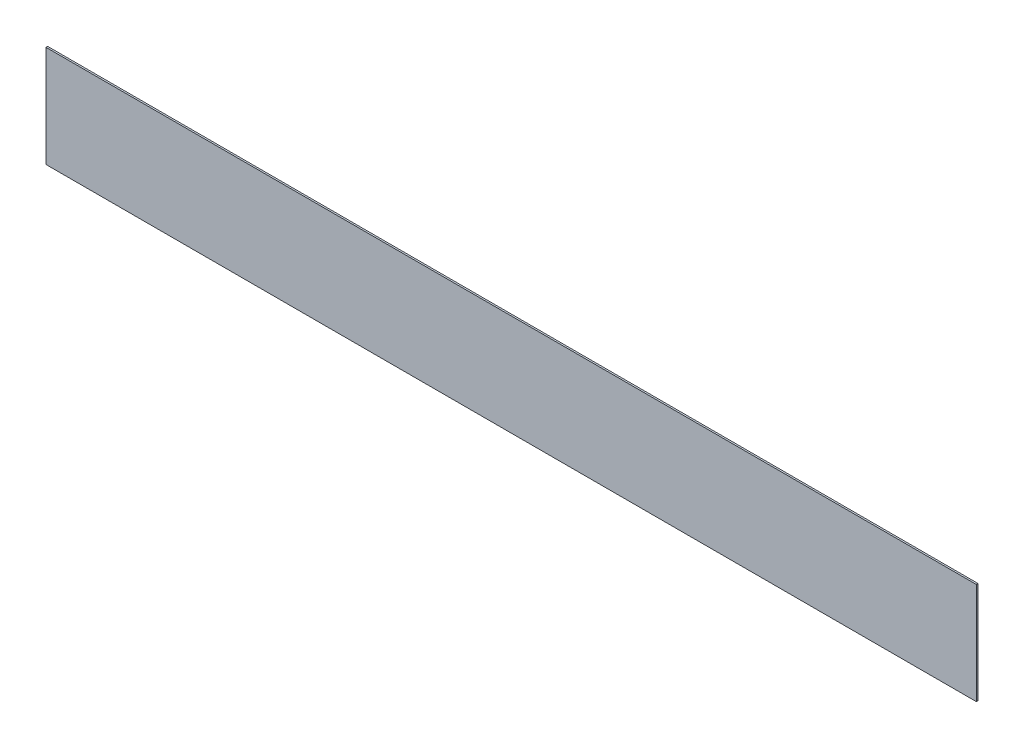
ISO-10303-21;
HEADER;
FILE_DESCRIPTION(('STEP AP214'),'2;1');
FILE_NAME('part.step','',(''),(''),'','','');
FILE_SCHEMA(('AUTOMOTIVE_DESIGN { 1 0 10303 214 1 1 1 1 }'));
ENDSEC;
DATA;
#1=APPLICATION_CONTEXT('core data for automotive mechanical design processes');
#2=APPLICATION_PROTOCOL_DEFINITION('international standard','automotive_design',2000,#1);
#3=PRODUCT_CONTEXT('',#1,'mechanical');
#4=PRODUCT('Part','Part','',(#3));
#5=PRODUCT_RELATED_PRODUCT_CATEGORY('part','',(#4));
#6=PRODUCT_DEFINITION_FORMATION('','',#4);
#7=PRODUCT_DEFINITION_CONTEXT('part definition',#1,'design');
#8=PRODUCT_DEFINITION('design','',#6,#7);
#9=PRODUCT_DEFINITION_SHAPE('','',#8);
#10=(LENGTH_UNIT() NAMED_UNIT(*) SI_UNIT(.MILLI.,.METRE.));
#11=(NAMED_UNIT(*) PLANE_ANGLE_UNIT() SI_UNIT($,.RADIAN.));
#12=(NAMED_UNIT(*) SI_UNIT($,.STERADIAN.) SOLID_ANGLE_UNIT());
#13=UNCERTAINTY_MEASURE_WITH_UNIT(LENGTH_MEASURE(1.E-05),#10,'distance_accuracy_value','');
#14=(GEOMETRIC_REPRESENTATION_CONTEXT(3) GLOBAL_UNCERTAINTY_ASSIGNED_CONTEXT((#13)) GLOBAL_UNIT_ASSIGNED_CONTEXT((#10,
#11,#12)) REPRESENTATION_CONTEXT('',''));
#15=CARTESIAN_POINT('',(0.,0.,0.));
#16=DIRECTION('',(0.,0.,1.));
#17=DIRECTION('',(1.,0.,0.));
#18=AXIS2_PLACEMENT_3D('',#15,#16,#17);
#19=CARTESIAN_POINT('',(550.,-30.,0.999999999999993));
#20=DIRECTION('',(0.,1.,0.));
#21=DIRECTION('',(0.,0.,1.));
#22=AXIS2_PLACEMENT_3D('',#19,#20,#21);
#23=PLANE('',#22);
#24=DIRECTION('',(0.,0.,-1.));
#25=VECTOR('',#24,1.);
#26=CARTESIAN_POINT('',(0.,-30.,0.999999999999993));
#27=LINE('',#26,#25);
#28=CARTESIAN_POINT('',(0.,-30.,0.999999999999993));
#29=VERTEX_POINT('',#28);
#30=CARTESIAN_POINT('',(0.,-30.,0.));
#31=VERTEX_POINT('',#30);
#32=EDGE_CURVE('E95',#29,#31,#27,.T.);
#33=ORIENTED_EDGE('',*,*,#32,.T.);
#34=DIRECTION('',(-1.,0.,0.));
#35=VECTOR('',#34,1.);
#36=CARTESIAN_POINT('',(550.,-30.,0.));
#37=LINE('',#36,#35);
#38=CARTESIAN_POINT('',(550.,-30.,0.));
#39=VERTEX_POINT('',#38);
#40=EDGE_CURVE('E11',#39,#31,#37,.T.);
#41=ORIENTED_EDGE('',*,*,#40,.F.);
#42=DIRECTION('',(0.,0.,-1.));
#43=VECTOR('',#42,1.);
#44=CARTESIAN_POINT('',(550.,-30.,0.999999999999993));
#45=LINE('',#44,#43);
#46=CARTESIAN_POINT('',(550.,-30.,0.999999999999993));
#47=VERTEX_POINT('',#46);
#48=EDGE_CURVE('E83',#47,#39,#45,.T.);
#49=ORIENTED_EDGE('',*,*,#48,.F.);
#50=DIRECTION('',(-1.,0.,0.));
#51=VECTOR('',#50,1.);
#52=CARTESIAN_POINT('',(550.,-30.,0.999999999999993));
#53=LINE('',#52,#51);
#54=EDGE_CURVE('E91',#47,#29,#53,.T.);
#55=ORIENTED_EDGE('',*,*,#54,.T.);
#56=EDGE_LOOP('',(#33,#41,#49,#55));
#57=FACE_BOUND('',#56,.T.);
#58=ADVANCED_FACE('F32',(#57),#23,.F.);
#59=CARTESIAN_POINT('',(550.,-30.,0.));
#60=DIRECTION('',(0.,0.,1.));
#61=DIRECTION('',(1.,0.,0.));
#62=AXIS2_PLACEMENT_3D('',#59,#60,#61);
#63=PLANE('',#62);
#64=DIRECTION('',(0.,1.,0.));
#65=VECTOR('',#64,1.);
#66=CARTESIAN_POINT('',(0.,-30.,0.));
#67=LINE('',#66,#65);
#68=CARTESIAN_POINT('',(0.,30.,0.));
#69=VERTEX_POINT('',#68);
#70=EDGE_CURVE('E87',#31,#69,#67,.T.);
#71=ORIENTED_EDGE('',*,*,#70,.T.);
#72=DIRECTION('',(-1.,0.,0.));
#73=VECTOR('',#72,1.);
#74=CARTESIAN_POINT('',(550.,30.,0.));
#75=LINE('',#74,#73);
#76=CARTESIAN_POINT('',(550.,30.,0.));
#77=VERTEX_POINT('',#76);
#78=EDGE_CURVE('E40',#77,#69,#75,.T.);
#79=ORIENTED_EDGE('',*,*,#78,.F.);
#80=DIRECTION('',(0.,1.,0.));
#81=VECTOR('',#80,1.);
#82=CARTESIAN_POINT('',(550.,-30.,0.));
#83=LINE('',#82,#81);
#84=EDGE_CURVE('E78',#39,#77,#83,.T.);
#85=ORIENTED_EDGE('',*,*,#84,.F.);
#86=ORIENTED_EDGE('',*,*,#40,.T.);
#87=EDGE_LOOP('',(#71,#79,#85,#86));
#88=FACE_BOUND('',#87,.T.);
#89=ADVANCED_FACE('F86',(#88),#63,.F.);
#90=CARTESIAN_POINT('',(550.,30.,0.));
#91=DIRECTION('',(0.,-1.,0.));
#92=DIRECTION('',(0.,0.,-1.));
#93=AXIS2_PLACEMENT_3D('',#90,#91,#92);
#94=PLANE('',#93);
#95=DIRECTION('',(0.,0.,1.));
#96=VECTOR('',#95,1.);
#97=CARTESIAN_POINT('',(0.,30.,0.));
#98=LINE('',#97,#96);
#99=CARTESIAN_POINT('',(0.,30.,0.999999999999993));
#100=VERTEX_POINT('',#99);
#101=EDGE_CURVE('E65',#69,#100,#98,.T.);
#102=ORIENTED_EDGE('',*,*,#101,.T.);
#103=DIRECTION('',(-1.,0.,0.));
#104=VECTOR('',#103,1.);
#105=CARTESIAN_POINT('',(550.,30.,0.999999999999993));
#106=LINE('',#105,#104);
#107=CARTESIAN_POINT('',(550.,30.,0.999999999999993));
#108=VERTEX_POINT('',#107);
#109=EDGE_CURVE('E88',#108,#100,#106,.T.);
#110=ORIENTED_EDGE('',*,*,#109,.F.);
#111=DIRECTION('',(0.,0.,1.));
#112=VECTOR('',#111,1.);
#113=CARTESIAN_POINT('',(550.,30.,0.));
#114=LINE('',#113,#112);
#115=EDGE_CURVE('E81',#77,#108,#114,.T.);
#116=ORIENTED_EDGE('',*,*,#115,.F.);
#117=ORIENTED_EDGE('',*,*,#78,.T.);
#118=EDGE_LOOP('',(#102,#110,#116,#117));
#119=FACE_BOUND('',#118,.T.);
#120=ADVANCED_FACE('F89',(#119),#94,.F.);
#121=CARTESIAN_POINT('',(550.,30.,0.999999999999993));
#122=DIRECTION('',(0.,0.,-1.));
#123=DIRECTION('',(-1.,0.,0.));
#124=AXIS2_PLACEMENT_3D('',#121,#122,#123);
#125=PLANE('',#124);
#126=DIRECTION('',(0.,-1.,0.));
#127=VECTOR('',#126,1.);
#128=CARTESIAN_POINT('',(0.,30.,0.999999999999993));
#129=LINE('',#128,#127);
#130=EDGE_CURVE('E71',#100,#29,#129,.T.);
#131=ORIENTED_EDGE('',*,*,#130,.T.);
#132=ORIENTED_EDGE('',*,*,#54,.F.);
#133=DIRECTION('',(0.,-1.,0.));
#134=VECTOR('',#133,1.);
#135=CARTESIAN_POINT('',(550.,30.,0.999999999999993));
#136=LINE('',#135,#134);
#137=EDGE_CURVE('E48',#108,#47,#136,.T.);
#138=ORIENTED_EDGE('',*,*,#137,.F.);
#139=ORIENTED_EDGE('',*,*,#109,.T.);
#140=EDGE_LOOP('',(#131,#132,#138,#139));
#141=FACE_BOUND('',#140,.T.);
#142=ADVANCED_FACE('F102',(#141),#125,.F.);
#143=CARTESIAN_POINT('',(550.,-30.,0.));
#144=DIRECTION('',(1.,0.,0.));
#145=DIRECTION('',(0.,0.,-1.));
#146=AXIS2_PLACEMENT_3D('',#143,#144,#145);
#147=PLANE('',#146);
#148=ORIENTED_EDGE('',*,*,#48,.T.);
#149=ORIENTED_EDGE('',*,*,#84,.T.);
#150=ORIENTED_EDGE('',*,*,#115,.T.);
#151=ORIENTED_EDGE('',*,*,#137,.T.);
#152=EDGE_LOOP('',(#148,#149,#150,#151));
#153=FACE_BOUND('',#152,.T.);
#154=ADVANCED_FACE('F79',(#153),#147,.T.);
#155=CARTESIAN_POINT('',(0.,-30.,0.));
#156=DIRECTION('',(1.,0.,0.));
#157=DIRECTION('',(0.,0.,-1.));
#158=AXIS2_PLACEMENT_3D('',#155,#156,#157);
#159=PLANE('',#158);
#160=ORIENTED_EDGE('',*,*,#32,.F.);
#161=ORIENTED_EDGE('',*,*,#130,.F.);
#162=ORIENTED_EDGE('',*,*,#101,.F.);
#163=ORIENTED_EDGE('',*,*,#70,.F.);
#164=EDGE_LOOP('',(#160,#161,#162,#163));
#165=FACE_BOUND('',#164,.T.);
#166=ADVANCED_FACE('F105',(#165),#159,.F.);
#167=CLOSED_SHELL('',(#58,#89,#120,#142,#154,#166));
#168=MANIFOLD_SOLID_BREP('B2',#167);
#169=ADVANCED_BREP_SHAPE_REPRESENTATION('',(#18,#168),#14);
#170=SHAPE_DEFINITION_REPRESENTATION(#9,#169);
ENDSEC;
END-ISO-10303-21;
